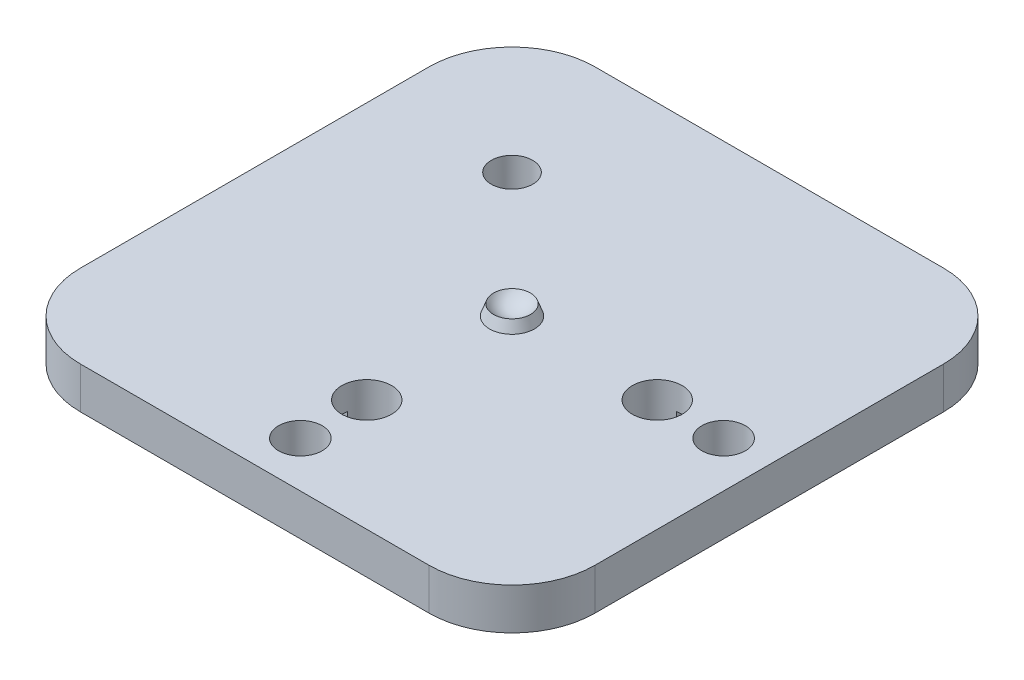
ISO-10303-21;
HEADER;
FILE_DESCRIPTION(('STEP AP214'),'2;1');
FILE_NAME('part.step','',(''),(''),'','','');
FILE_SCHEMA(('AUTOMOTIVE_DESIGN { 1 0 10303 214 1 1 1 1 }'));
ENDSEC;
DATA;
#1=APPLICATION_CONTEXT('core data for automotive mechanical design processes');
#2=APPLICATION_PROTOCOL_DEFINITION('international standard','automotive_design',2000,#1);
#3=PRODUCT_CONTEXT('',#1,'mechanical');
#4=PRODUCT('Part','Part','',(#3));
#5=PRODUCT_RELATED_PRODUCT_CATEGORY('part','',(#4));
#6=PRODUCT_DEFINITION_FORMATION('','',#4);
#7=PRODUCT_DEFINITION_CONTEXT('part definition',#1,'design');
#8=PRODUCT_DEFINITION('design','',#6,#7);
#9=PRODUCT_DEFINITION_SHAPE('','',#8);
#10=(LENGTH_UNIT() NAMED_UNIT(*) SI_UNIT(.MILLI.,.METRE.));
#11=(NAMED_UNIT(*) PLANE_ANGLE_UNIT() SI_UNIT($,.RADIAN.));
#12=(NAMED_UNIT(*) SI_UNIT($,.STERADIAN.) SOLID_ANGLE_UNIT());
#13=UNCERTAINTY_MEASURE_WITH_UNIT(LENGTH_MEASURE(1.E-05),#10,'distance_accuracy_value','');
#14=(GEOMETRIC_REPRESENTATION_CONTEXT(3) GLOBAL_UNCERTAINTY_ASSIGNED_CONTEXT((#13)) GLOBAL_UNIT_ASSIGNED_CONTEXT((#10,
#11,#12)) REPRESENTATION_CONTEXT('',''));
#15=CARTESIAN_POINT('',(0.,0.,0.));
#16=DIRECTION('',(0.,0.,1.));
#17=DIRECTION('',(1.,0.,0.));
#18=AXIS2_PLACEMENT_3D('',#15,#16,#17);
#19=CARTESIAN_POINT('',(0.,0.,0.));
#20=DIRECTION('',(0.,-1.,0.));
#21=DIRECTION('',(0.,0.,-1.));
#22=AXIS2_PLACEMENT_3D('',#19,#20,#21);
#23=CONICAL_SURFACE('',#22,2.7,0.349065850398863);
#24=CARTESIAN_POINT('',(0.,1.28250536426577,0.));
#25=DIRECTION('',(0.,1.,0.));
#26=DIRECTION('',(0.,0.,1.));
#27=AXIS2_PLACEMENT_3D('',#24,#25,#26);
#28=CIRCLE('',#27,2.23320622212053);
#29=CARTESIAN_POINT('',(0.,1.28250536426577,2.23320622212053));
#30=VERTEX_POINT('',#29);
#31=EDGE_CURVE('E421',#30,#30,#28,.T.);
#32=ORIENTED_EDGE('',*,*,#31,.F.);
#33=EDGE_LOOP('',(#32));
#34=FACE_BOUND('',#33,.T.);
#35=CARTESIAN_POINT('',(0.,0.,0.));
#36=DIRECTION('',(0.,1.,0.));
#37=DIRECTION('',(0.,0.,1.));
#38=AXIS2_PLACEMENT_3D('',#35,#36,#37);
#39=CIRCLE('',#38,2.7);
#40=CARTESIAN_POINT('',(0.,0.,2.7));
#41=VERTEX_POINT('',#40);
#42=EDGE_CURVE('E411',#41,#41,#39,.T.);
#43=ORIENTED_EDGE('',*,*,#42,.T.);
#44=EDGE_LOOP('',(#43));
#45=FACE_BOUND('',#44,.T.);
#46=ADVANCED_FACE('F41',(#34,#45),#23,.T.);
#47=CARTESIAN_POINT('',(0.,2.8,0.));
#48=DIRECTION('',(0.,1.,0.));
#49=DIRECTION('',(1.,0.,0.));
#50=AXIS2_PLACEMENT_3D('',#47,#48,#49);
#51=SPHERICAL_SURFACE('',#50,2.7);
#52=ORIENTED_EDGE('',*,*,#31,.T.);
#53=EDGE_LOOP('',(#52));
#54=FACE_BOUND('',#53,.T.);
#55=ADVANCED_FACE('F534',(#54),#51,.F.);
#56=CARTESIAN_POINT('',(0.,-5.,0.));
#57=DIRECTION('',(0.,1.,0.));
#58=DIRECTION('',(0.,0.,1.));
#59=AXIS2_PLACEMENT_3D('',#56,#57,#58);
#60=PLANE('',#59);
#61=DIRECTION('',(0.,0.,-1.));
#62=VECTOR('',#61,1.);
#63=CARTESIAN_POINT('',(-31.,-5.,-31.));
#64=LINE('',#63,#62);
#65=CARTESIAN_POINT('',(-31.,-5.,21.));
#66=VERTEX_POINT('',#65);
#67=CARTESIAN_POINT('',(-31.,-5.,-21.));
#68=VERTEX_POINT('',#67);
#69=EDGE_CURVE('E405',#66,#68,#64,.T.);
#70=ORIENTED_EDGE('',*,*,#69,.T.);
#71=CARTESIAN_POINT('',(-21.,-5.,-21.));
#72=DIRECTION('',(0.,1.,0.));
#73=DIRECTION('',(0.,0.,1.));
#74=AXIS2_PLACEMENT_3D('',#71,#72,#73);
#75=CIRCLE('',#74,10.);
#76=CARTESIAN_POINT('',(-21.,-5.,-31.));
#77=VERTEX_POINT('',#76);
#78=EDGE_CURVE('E486',#68,#77,#75,.F.);
#79=ORIENTED_EDGE('',*,*,#78,.T.);
#80=DIRECTION('',(1.,0.,0.));
#81=VECTOR('',#80,1.);
#82=CARTESIAN_POINT('',(-31.,-5.,-31.));
#83=LINE('',#82,#81);
#84=CARTESIAN_POINT('',(21.,-5.,-31.));
#85=VERTEX_POINT('',#84);
#86=EDGE_CURVE('E408',#77,#85,#83,.T.);
#87=ORIENTED_EDGE('',*,*,#86,.T.);
#88=CARTESIAN_POINT('',(21.,-5.,-21.));
#89=DIRECTION('',(0.,1.,0.));
#90=DIRECTION('',(0.,0.,1.));
#91=AXIS2_PLACEMENT_3D('',#88,#89,#90);
#92=CIRCLE('',#91,10.);
#93=CARTESIAN_POINT('',(31.,-5.,-21.));
#94=VERTEX_POINT('',#93);
#95=EDGE_CURVE('E484',#85,#94,#92,.F.);
#96=ORIENTED_EDGE('',*,*,#95,.T.);
#97=DIRECTION('',(0.,0.,1.));
#98=VECTOR('',#97,1.);
#99=CARTESIAN_POINT('',(31.,-5.,-31.));
#100=LINE('',#99,#98);
#101=CARTESIAN_POINT('',(31.,-5.,21.));
#102=VERTEX_POINT('',#101);
#103=EDGE_CURVE('E400',#94,#102,#100,.T.);
#104=ORIENTED_EDGE('',*,*,#103,.T.);
#105=CARTESIAN_POINT('',(21.,-5.,21.));
#106=DIRECTION('',(0.,1.,0.));
#107=DIRECTION('',(0.,0.,1.));
#108=AXIS2_PLACEMENT_3D('',#105,#106,#107);
#109=CIRCLE('',#108,10.);
#110=CARTESIAN_POINT('',(21.,-5.,31.));
#111=VERTEX_POINT('',#110);
#112=EDGE_CURVE('E61',#102,#111,#109,.F.);
#113=ORIENTED_EDGE('',*,*,#112,.T.);
#114=DIRECTION('',(-1.,0.,0.));
#115=VECTOR('',#114,1.);
#116=CARTESIAN_POINT('',(-31.,-5.,31.));
#117=LINE('',#116,#115);
#118=CARTESIAN_POINT('',(-21.,-5.,31.));
#119=VERTEX_POINT('',#118);
#120=EDGE_CURVE('E402',#111,#119,#117,.T.);
#121=ORIENTED_EDGE('',*,*,#120,.T.);
#122=CARTESIAN_POINT('',(-21.,-5.,21.));
#123=DIRECTION('',(0.,1.,0.));
#124=DIRECTION('',(0.,0.,1.));
#125=AXIS2_PLACEMENT_3D('',#122,#123,#124);
#126=CIRCLE('',#125,10.);
#127=EDGE_CURVE('E482',#119,#66,#126,.F.);
#128=ORIENTED_EDGE('',*,*,#127,.T.);
#129=EDGE_LOOP('',(#70,#79,#87,#96,#104,#113,#121,#128));
#130=FACE_BOUND('',#129,.T.);
#131=CARTESIAN_POINT('',(17.5,-5.,0.));
#132=DIRECTION('',(0.,-1.,0.));
#133=DIRECTION('',(0.,0.,-1.));
#134=AXIS2_PLACEMENT_3D('',#131,#132,#133);
#135=CIRCLE('',#134,2.99999999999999);
#136=CARTESIAN_POINT('',(16.9,-5.,2.93938769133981));
#137=VERTEX_POINT('',#136);
#138=CARTESIAN_POINT('',(16.9,-5.,-2.93938769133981));
#139=VERTEX_POINT('',#138);
#140=EDGE_CURVE('E396',#137,#139,#135,.T.);
#141=ORIENTED_EDGE('',*,*,#140,.F.);
#142=DIRECTION('',(0.,0.,-1.));
#143=VECTOR('',#142,1.);
#144=CARTESIAN_POINT('',(16.9,-5.,-5.2));
#145=LINE('',#144,#143);
#146=CARTESIAN_POINT('',(16.9,-5.,5.2));
#147=VERTEX_POINT('',#146);
#148=EDGE_CURVE('E287',#147,#137,#145,.T.);
#149=ORIENTED_EDGE('',*,*,#148,.F.);
#150=DIRECTION('',(-1.,0.,0.));
#151=VECTOR('',#150,1.);
#152=CARTESIAN_POINT('',(16.9,-5.,5.2));
#153=LINE('',#152,#151);
#154=CARTESIAN_POINT('',(18.1,-5.,5.2));
#155=VERTEX_POINT('',#154);
#156=EDGE_CURVE('E312',#155,#147,#153,.T.);
#157=ORIENTED_EDGE('',*,*,#156,.F.);
#158=DIRECTION('',(0.,0.,1.));
#159=VECTOR('',#158,1.);
#160=CARTESIAN_POINT('',(18.1,-5.,5.2));
#161=LINE('',#160,#159);
#162=CARTESIAN_POINT('',(18.1,-5.,2.93938769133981));
#163=VERTEX_POINT('',#162);
#164=EDGE_CURVE('E315',#163,#155,#161,.T.);
#165=ORIENTED_EDGE('',*,*,#164,.F.);
#166=CARTESIAN_POINT('',(18.1,-5.,-2.93938769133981));
#167=VERTEX_POINT('',#166);
#168=EDGE_CURVE('E392',#167,#163,#135,.T.);
#169=ORIENTED_EDGE('',*,*,#168,.F.);
#170=CARTESIAN_POINT('',(18.1,-5.,-5.2));
#171=VERTEX_POINT('',#170);
#172=EDGE_CURVE('E317',#171,#167,#161,.T.);
#173=ORIENTED_EDGE('',*,*,#172,.F.);
#174=DIRECTION('',(1.,0.,0.));
#175=VECTOR('',#174,1.);
#176=CARTESIAN_POINT('',(18.1,-5.,-5.2));
#177=LINE('',#176,#175);
#178=CARTESIAN_POINT('',(16.9,-5.,-5.2));
#179=VERTEX_POINT('',#178);
#180=EDGE_CURVE('E319',#179,#171,#177,.T.);
#181=ORIENTED_EDGE('',*,*,#180,.F.);
#182=EDGE_CURVE('E322',#139,#179,#145,.T.);
#183=ORIENTED_EDGE('',*,*,#182,.F.);
#184=EDGE_LOOP('',(#141,#149,#157,#165,#169,#173,#181,#183));
#185=FACE_BOUND('',#184,.T.);
#186=CARTESIAN_POINT('',(0.,-5.,17.5));
#187=DIRECTION('',(0.,-1.,0.));
#188=DIRECTION('',(0.,0.,-1.));
#189=AXIS2_PLACEMENT_3D('',#186,#187,#188);
#190=CIRCLE('',#189,3.);
#191=CARTESIAN_POINT('',(2.93938769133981,-5.,18.1));
#192=VERTEX_POINT('',#191);
#193=CARTESIAN_POINT('',(-2.93938769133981,-5.,18.1));
#194=VERTEX_POINT('',#193);
#195=EDGE_CURVE('E388',#192,#194,#190,.T.);
#196=ORIENTED_EDGE('',*,*,#195,.F.);
#197=DIRECTION('',(-1.,0.,0.));
#198=VECTOR('',#197,1.);
#199=CARTESIAN_POINT('',(-5.2,-5.,18.1));
#200=LINE('',#199,#198);
#201=CARTESIAN_POINT('',(5.2,-5.,18.1));
#202=VERTEX_POINT('',#201);
#203=EDGE_CURVE('E277',#202,#192,#200,.T.);
#204=ORIENTED_EDGE('',*,*,#203,.F.);
#205=DIRECTION('',(0.,0.,1.));
#206=VECTOR('',#205,1.);
#207=CARTESIAN_POINT('',(5.2,-5.,18.1));
#208=LINE('',#207,#206);
#209=CARTESIAN_POINT('',(5.2,-5.,16.9));
#210=VERTEX_POINT('',#209);
#211=EDGE_CURVE('E290',#210,#202,#208,.T.);
#212=ORIENTED_EDGE('',*,*,#211,.F.);
#213=DIRECTION('',(1.,0.,0.));
#214=VECTOR('',#213,1.);
#215=CARTESIAN_POINT('',(5.2,-5.,16.9));
#216=LINE('',#215,#214);
#217=CARTESIAN_POINT('',(2.93938769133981,-5.,16.9));
#218=VERTEX_POINT('',#217);
#219=EDGE_CURVE('E286',#218,#210,#216,.T.);
#220=ORIENTED_EDGE('',*,*,#219,.F.);
#221=CARTESIAN_POINT('',(-2.93938769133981,-5.,16.9));
#222=VERTEX_POINT('',#221);
#223=EDGE_CURVE('E385',#222,#218,#190,.T.);
#224=ORIENTED_EDGE('',*,*,#223,.F.);
#225=CARTESIAN_POINT('',(-5.2,-5.,16.9));
#226=VERTEX_POINT('',#225);
#227=EDGE_CURVE('E288',#226,#222,#216,.T.);
#228=ORIENTED_EDGE('',*,*,#227,.F.);
#229=DIRECTION('',(0.,0.,-1.));
#230=VECTOR('',#229,1.);
#231=CARTESIAN_POINT('',(-5.2,-5.,16.9));
#232=LINE('',#231,#230);
#233=CARTESIAN_POINT('',(-5.2,-5.,18.1));
#234=VERTEX_POINT('',#233);
#235=EDGE_CURVE('E257',#234,#226,#232,.T.);
#236=ORIENTED_EDGE('',*,*,#235,.F.);
#237=EDGE_CURVE('E279',#194,#234,#200,.T.);
#238=ORIENTED_EDGE('',*,*,#237,.F.);
#239=EDGE_LOOP('',(#196,#204,#212,#220,#224,#228,#236,#238));
#240=FACE_BOUND('',#239,.T.);
#241=CARTESIAN_POINT('',(-15.,-5.,-15.));
#242=DIRECTION('',(0.,-1.,0.));
#243=DIRECTION('',(0.,0.,-1.));
#244=AXIS2_PLACEMENT_3D('',#241,#242,#243);
#245=CIRCLE('',#244,2.5);
#246=CARTESIAN_POINT('',(-12.859635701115,-5.,-16.2918361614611));
#247=VERTEX_POINT('',#246);
#248=CARTESIAN_POINT('',(-16.2918361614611,-5.,-12.859635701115));
#249=VERTEX_POINT('',#248);
#250=EDGE_CURVE('E382',#247,#249,#245,.T.);
#251=ORIENTED_EDGE('',*,*,#250,.F.);
#252=DIRECTION('',(-0.707106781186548,0.,0.707106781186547));
#253=VECTOR('',#252,1.);
#254=CARTESIAN_POINT('',(-18.2526911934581,-5.,-10.898780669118));
#255=LINE('',#254,#253);
#256=CARTESIAN_POINT('',(-10.898780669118,-5.,-18.2526911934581));
#257=VERTEX_POINT('',#256);
#258=EDGE_CURVE('E345',#257,#247,#255,.T.);
#259=ORIENTED_EDGE('',*,*,#258,.F.);
#260=DIRECTION('',(0.707106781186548,0.,0.707106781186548));
#261=VECTOR('',#260,1.);
#262=CARTESIAN_POINT('',(-10.898780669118,-5.,-18.2526911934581));
#263=LINE('',#262,#261);
#264=CARTESIAN_POINT('',(-11.7473088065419,-5.,-19.101219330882));
#265=VERTEX_POINT('',#264);
#266=EDGE_CURVE('E347',#265,#257,#263,.T.);
#267=ORIENTED_EDGE('',*,*,#266,.F.);
#268=DIRECTION('',(0.707106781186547,0.,-0.707106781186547));
#269=VECTOR('',#268,1.);
#270=CARTESIAN_POINT('',(-11.7473088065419,-5.,-19.101219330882));
#271=LINE('',#270,#269);
#272=CARTESIAN_POINT('',(-13.7081638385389,-5.,-17.140364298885));
#273=VERTEX_POINT('',#272);
#274=EDGE_CURVE('E351',#273,#265,#271,.T.);
#275=ORIENTED_EDGE('',*,*,#274,.F.);
#276=CARTESIAN_POINT('',(-17.140364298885,-5.,-13.7081638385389));
#277=VERTEX_POINT('',#276);
#278=EDGE_CURVE('E379',#277,#273,#245,.T.);
#279=ORIENTED_EDGE('',*,*,#278,.F.);
#280=CARTESIAN_POINT('',(-19.101219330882,-5.,-11.7473088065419));
#281=VERTEX_POINT('',#280);
#282=EDGE_CURVE('E352',#281,#277,#271,.T.);
#283=ORIENTED_EDGE('',*,*,#282,.F.);
#284=DIRECTION('',(-0.707106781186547,0.,-0.707106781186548));
#285=VECTOR('',#284,1.);
#286=CARTESIAN_POINT('',(-19.101219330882,-5.,-11.7473088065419));
#287=LINE('',#286,#285);
#288=CARTESIAN_POINT('',(-18.2526911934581,-5.,-10.898780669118));
#289=VERTEX_POINT('',#288);
#290=EDGE_CURVE('E311',#289,#281,#287,.T.);
#291=ORIENTED_EDGE('',*,*,#290,.F.);
#292=EDGE_CURVE('E348',#249,#289,#255,.T.);
#293=ORIENTED_EDGE('',*,*,#292,.F.);
#294=EDGE_LOOP('',(#251,#259,#267,#275,#279,#283,#291,#293));
#295=FACE_BOUND('',#294,.T.);
#296=CARTESIAN_POINT('',(0.,-5.,25.5));
#297=DIRECTION('',(0.,-1.,0.));
#298=DIRECTION('',(0.,0.,-1.));
#299=AXIS2_PLACEMENT_3D('',#296,#297,#298);
#300=CIRCLE('',#299,2.625);
#301=CARTESIAN_POINT('',(0.,-5.,22.875));
#302=VERTEX_POINT('',#301);
#303=EDGE_CURVE('E373',#302,#302,#300,.T.);
#304=ORIENTED_EDGE('',*,*,#303,.F.);
#305=EDGE_LOOP('',(#304));
#306=FACE_BOUND('',#305,.T.);
#307=CARTESIAN_POINT('',(25.5,-5.,0.));
#308=DIRECTION('',(0.,-1.,0.));
#309=DIRECTION('',(0.,0.,-1.));
#310=AXIS2_PLACEMENT_3D('',#307,#308,#309);
#311=CIRCLE('',#310,2.625);
#312=CARTESIAN_POINT('',(25.5,-5.,-2.625));
#313=VERTEX_POINT('',#312);
#314=EDGE_CURVE('E367',#313,#313,#311,.T.);
#315=ORIENTED_EDGE('',*,*,#314,.F.);
#316=EDGE_LOOP('',(#315));
#317=FACE_BOUND('',#316,.T.);
#318=ADVANCED_FACE('F512',(#130,#185,#240,#295,#306,#317),#60,.F.);
#319=CARTESIAN_POINT('',(0.,0.,0.));
#320=DIRECTION('',(0.,1.,0.));
#321=DIRECTION('',(0.,0.,1.));
#322=AXIS2_PLACEMENT_3D('',#319,#320,#321);
#323=PLANE('',#322);
#324=ORIENTED_EDGE('',*,*,#42,.F.);
#325=EDGE_LOOP('',(#324));
#326=FACE_BOUND('',#325,.T.);
#327=CARTESIAN_POINT('',(0.,0.,25.5));
#328=DIRECTION('',(0.,-1.,0.));
#329=DIRECTION('',(0.,0.,-1.));
#330=AXIS2_PLACEMENT_3D('',#327,#328,#329);
#331=CIRCLE('',#330,2.625);
#332=CARTESIAN_POINT('',(0.,0.,22.875));
#333=VERTEX_POINT('',#332);
#334=EDGE_CURVE('E370',#333,#333,#331,.T.);
#335=ORIENTED_EDGE('',*,*,#334,.T.);
#336=EDGE_LOOP('',(#335));
#337=FACE_BOUND('',#336,.T.);
#338=CARTESIAN_POINT('',(0.,0.,17.5));
#339=DIRECTION('',(0.,-1.,0.));
#340=DIRECTION('',(0.,0.,-1.));
#341=AXIS2_PLACEMENT_3D('',#338,#339,#340);
#342=CIRCLE('',#341,3.);
#343=CARTESIAN_POINT('',(0.,0.,14.5));
#344=VERTEX_POINT('',#343);
#345=EDGE_CURVE('E389',#344,#344,#342,.T.);
#346=ORIENTED_EDGE('',*,*,#345,.T.);
#347=EDGE_LOOP('',(#346));
#348=FACE_BOUND('',#347,.T.);
#349=DIRECTION('',(1.,0.,0.));
#350=VECTOR('',#349,1.);
#351=CARTESIAN_POINT('',(-31.,0.,-31.));
#352=LINE('',#351,#350);
#353=CARTESIAN_POINT('',(-21.,0.,-31.));
#354=VERTEX_POINT('',#353);
#355=CARTESIAN_POINT('',(21.,0.,-31.));
#356=VERTEX_POINT('',#355);
#357=EDGE_CURVE('E403',#354,#356,#352,.T.);
#358=ORIENTED_EDGE('',*,*,#357,.F.);
#359=CARTESIAN_POINT('',(-21.,0.,-21.));
#360=DIRECTION('',(0.,1.,0.));
#361=DIRECTION('',(0.,0.,1.));
#362=AXIS2_PLACEMENT_3D('',#359,#360,#361);
#363=CIRCLE('',#362,10.);
#364=CARTESIAN_POINT('',(-31.,0.,-21.));
#365=VERTEX_POINT('',#364);
#366=EDGE_CURVE('E474',#354,#365,#363,.T.);
#367=ORIENTED_EDGE('',*,*,#366,.T.);
#368=DIRECTION('',(0.,0.,-1.));
#369=VECTOR('',#368,1.);
#370=CARTESIAN_POINT('',(-31.,0.,-31.));
#371=LINE('',#370,#369);
#372=CARTESIAN_POINT('',(-31.,0.,21.));
#373=VERTEX_POINT('',#372);
#374=EDGE_CURVE('E416',#373,#365,#371,.T.);
#375=ORIENTED_EDGE('',*,*,#374,.F.);
#376=CARTESIAN_POINT('',(-21.,0.,21.));
#377=DIRECTION('',(0.,1.,0.));
#378=DIRECTION('',(0.,0.,1.));
#379=AXIS2_PLACEMENT_3D('',#376,#377,#378);
#380=CIRCLE('',#379,10.);
#381=CARTESIAN_POINT('',(-21.,0.,31.));
#382=VERTEX_POINT('',#381);
#383=EDGE_CURVE('E470',#373,#382,#380,.T.);
#384=ORIENTED_EDGE('',*,*,#383,.T.);
#385=DIRECTION('',(-1.,0.,0.));
#386=VECTOR('',#385,1.);
#387=CARTESIAN_POINT('',(-31.,0.,31.));
#388=LINE('',#387,#386);
#389=CARTESIAN_POINT('',(21.,0.,31.));
#390=VERTEX_POINT('',#389);
#391=EDGE_CURVE('E414',#390,#382,#388,.T.);
#392=ORIENTED_EDGE('',*,*,#391,.F.);
#393=CARTESIAN_POINT('',(21.,0.,21.));
#394=DIRECTION('',(0.,1.,0.));
#395=DIRECTION('',(0.,0.,1.));
#396=AXIS2_PLACEMENT_3D('',#393,#394,#395);
#397=CIRCLE('',#396,10.);
#398=CARTESIAN_POINT('',(31.,0.,21.));
#399=VERTEX_POINT('',#398);
#400=EDGE_CURVE('E468',#390,#399,#397,.T.);
#401=ORIENTED_EDGE('',*,*,#400,.T.);
#402=DIRECTION('',(0.,0.,1.));
#403=VECTOR('',#402,1.);
#404=CARTESIAN_POINT('',(31.,0.,-31.));
#405=LINE('',#404,#403);
#406=CARTESIAN_POINT('',(31.,0.,-21.));
#407=VERTEX_POINT('',#406);
#408=EDGE_CURVE('E395',#407,#399,#405,.T.);
#409=ORIENTED_EDGE('',*,*,#408,.F.);
#410=CARTESIAN_POINT('',(21.,0.,-21.));
#411=DIRECTION('',(0.,1.,0.));
#412=DIRECTION('',(0.,0.,1.));
#413=AXIS2_PLACEMENT_3D('',#410,#411,#412);
#414=CIRCLE('',#413,10.);
#415=EDGE_CURVE('E472',#407,#356,#414,.T.);
#416=ORIENTED_EDGE('',*,*,#415,.T.);
#417=EDGE_LOOP('',(#358,#367,#375,#384,#392,#401,#409,#416));
#418=FACE_BOUND('',#417,.T.);
#419=CARTESIAN_POINT('',(17.5,0.,0.));
#420=DIRECTION('',(0.,-1.,0.));
#421=DIRECTION('',(0.,0.,-1.));
#422=AXIS2_PLACEMENT_3D('',#419,#420,#421);
#423=CIRCLE('',#422,2.99999999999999);
#424=CARTESIAN_POINT('',(17.5,0.,-2.99999999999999));
#425=VERTEX_POINT('',#424);
#426=EDGE_CURVE('E397',#425,#425,#423,.T.);
#427=ORIENTED_EDGE('',*,*,#426,.T.);
#428=EDGE_LOOP('',(#427));
#429=FACE_BOUND('',#428,.T.);
#430=CARTESIAN_POINT('',(-15.,0.,-15.));
#431=DIRECTION('',(0.,-1.,0.));
#432=DIRECTION('',(0.,0.,-1.));
#433=AXIS2_PLACEMENT_3D('',#430,#431,#432);
#434=CIRCLE('',#433,2.5);
#435=CARTESIAN_POINT('',(-15.,0.,-17.5));
#436=VERTEX_POINT('',#435);
#437=EDGE_CURVE('E376',#436,#436,#434,.T.);
#438=ORIENTED_EDGE('',*,*,#437,.T.);
#439=EDGE_LOOP('',(#438));
#440=FACE_BOUND('',#439,.T.);
#441=CARTESIAN_POINT('',(25.5,0.,0.));
#442=DIRECTION('',(0.,-1.,0.));
#443=DIRECTION('',(0.,0.,-1.));
#444=AXIS2_PLACEMENT_3D('',#441,#442,#443);
#445=CIRCLE('',#444,2.625);
#446=CARTESIAN_POINT('',(25.5,0.,-2.625));
#447=VERTEX_POINT('',#446);
#448=EDGE_CURVE('E295',#447,#447,#445,.T.);
#449=ORIENTED_EDGE('',*,*,#448,.T.);
#450=EDGE_LOOP('',(#449));
#451=FACE_BOUND('',#450,.T.);
#452=ADVANCED_FACE('F499',(#326,#337,#348,#418,#429,#440,#451),#323,.T.);
#453=CARTESIAN_POINT('',(31.,-5.,-31.));
#454=DIRECTION('',(-1.,0.,0.));
#455=DIRECTION('',(0.,0.,1.));
#456=AXIS2_PLACEMENT_3D('',#453,#454,#455);
#457=PLANE('',#456);
#458=ORIENTED_EDGE('',*,*,#103,.F.);
#459=DIRECTION('',(0.,1.,0.));
#460=VECTOR('',#459,1.);
#461=CARTESIAN_POINT('',(31.,-5.,-21.));
#462=LINE('',#461,#460);
#463=EDGE_CURVE('E490',#94,#407,#462,.T.);
#464=ORIENTED_EDGE('',*,*,#463,.T.);
#465=ORIENTED_EDGE('',*,*,#408,.T.);
#466=DIRECTION('',(0.,1.,0.));
#467=VECTOR('',#466,1.);
#468=CARTESIAN_POINT('',(31.,-5.,21.));
#469=LINE('',#468,#467);
#470=EDGE_CURVE('E488',#399,#102,#469,.F.);
#471=ORIENTED_EDGE('',*,*,#470,.T.);
#472=EDGE_LOOP('',(#458,#464,#465,#471));
#473=FACE_BOUND('',#472,.T.);
#474=ADVANCED_FACE('F527',(#473),#457,.F.);
#475=CARTESIAN_POINT('',(-31.,-5.,31.));
#476=DIRECTION('',(0.,0.,-1.));
#477=DIRECTION('',(-1.,0.,0.));
#478=AXIS2_PLACEMENT_3D('',#475,#476,#477);
#479=PLANE('',#478);
#480=ORIENTED_EDGE('',*,*,#391,.T.);
#481=DIRECTION('',(0.,1.,0.));
#482=VECTOR('',#481,1.);
#483=CARTESIAN_POINT('',(-21.,-5.,31.));
#484=LINE('',#483,#482);
#485=EDGE_CURVE('E11',#382,#119,#484,.F.);
#486=ORIENTED_EDGE('',*,*,#485,.T.);
#487=ORIENTED_EDGE('',*,*,#120,.F.);
#488=DIRECTION('',(0.,1.,0.));
#489=VECTOR('',#488,1.);
#490=CARTESIAN_POINT('',(21.,-5.,31.));
#491=LINE('',#490,#489);
#492=EDGE_CURVE('E49',#111,#390,#491,.T.);
#493=ORIENTED_EDGE('',*,*,#492,.T.);
#494=EDGE_LOOP('',(#480,#486,#487,#493));
#495=FACE_BOUND('',#494,.T.);
#496=ADVANCED_FACE('F495',(#495),#479,.F.);
#497=CARTESIAN_POINT('',(-31.,-5.,-31.));
#498=DIRECTION('',(1.,0.,0.));
#499=DIRECTION('',(0.,0.,-1.));
#500=AXIS2_PLACEMENT_3D('',#497,#498,#499);
#501=PLANE('',#500);
#502=ORIENTED_EDGE('',*,*,#374,.T.);
#503=DIRECTION('',(0.,1.,0.));
#504=VECTOR('',#503,1.);
#505=CARTESIAN_POINT('',(-31.,-5.,-21.));
#506=LINE('',#505,#504);
#507=EDGE_CURVE('E479',#365,#68,#506,.F.);
#508=ORIENTED_EDGE('',*,*,#507,.T.);
#509=ORIENTED_EDGE('',*,*,#69,.F.);
#510=DIRECTION('',(0.,1.,0.));
#511=VECTOR('',#510,1.);
#512=CARTESIAN_POINT('',(-31.,-5.,21.));
#513=LINE('',#512,#511);
#514=EDGE_CURVE('E476',#66,#373,#513,.T.);
#515=ORIENTED_EDGE('',*,*,#514,.T.);
#516=EDGE_LOOP('',(#502,#508,#509,#515));
#517=FACE_BOUND('',#516,.T.);
#518=ADVANCED_FACE('F509',(#517),#501,.F.);
#519=CARTESIAN_POINT('',(-31.,-5.,-31.));
#520=DIRECTION('',(0.,0.,1.));
#521=DIRECTION('',(1.,0.,0.));
#522=AXIS2_PLACEMENT_3D('',#519,#520,#521);
#523=PLANE('',#522);
#524=ORIENTED_EDGE('',*,*,#86,.F.);
#525=DIRECTION('',(0.,1.,0.));
#526=VECTOR('',#525,1.);
#527=CARTESIAN_POINT('',(-21.,-5.,-31.));
#528=LINE('',#527,#526);
#529=EDGE_CURVE('E465',#77,#354,#528,.T.);
#530=ORIENTED_EDGE('',*,*,#529,.T.);
#531=ORIENTED_EDGE('',*,*,#357,.T.);
#532=DIRECTION('',(0.,1.,0.));
#533=VECTOR('',#532,1.);
#534=CARTESIAN_POINT('',(21.,-5.,-31.));
#535=LINE('',#534,#533);
#536=EDGE_CURVE('E463',#356,#85,#535,.F.);
#537=ORIENTED_EDGE('',*,*,#536,.T.);
#538=EDGE_LOOP('',(#524,#530,#531,#537));
#539=FACE_BOUND('',#538,.T.);
#540=ADVANCED_FACE('F519',(#539),#523,.F.);
#541=CARTESIAN_POINT('',(17.5,-5.,0.));
#542=DIRECTION('',(0.,1.,0.));
#543=DIRECTION('',(0.,0.,1.));
#544=AXIS2_PLACEMENT_3D('',#541,#542,#543);
#545=CYLINDRICAL_SURFACE('',#544,2.99999999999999);
#546=DIRECTION('',(0.,1.,0.));
#547=VECTOR('',#546,1.);
#548=CARTESIAN_POINT('',(16.9,-5.,-2.93938769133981));
#549=LINE('',#548,#547);
#550=CARTESIAN_POINT('',(16.9,-3.,-2.93938769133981));
#551=VERTEX_POINT('',#550);
#552=EDGE_CURVE('E461',#551,#139,#549,.F.);
#553=ORIENTED_EDGE('',*,*,#552,.F.);
#554=CARTESIAN_POINT('',(17.5,-3.,0.));
#555=DIRECTION('',(0.,1.,0.));
#556=DIRECTION('',(0.,0.,1.));
#557=AXIS2_PLACEMENT_3D('',#554,#555,#556);
#558=CIRCLE('',#557,2.99999999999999);
#559=CARTESIAN_POINT('',(18.1,-3.,-2.93938769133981));
#560=VERTEX_POINT('',#559);
#561=EDGE_CURVE('E453',#560,#551,#558,.T.);
#562=ORIENTED_EDGE('',*,*,#561,.F.);
#563=DIRECTION('',(0.,1.,0.));
#564=VECTOR('',#563,1.);
#565=CARTESIAN_POINT('',(18.1,-5.,-2.93938769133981));
#566=LINE('',#565,#564);
#567=EDGE_CURVE('E458',#167,#560,#566,.T.);
#568=ORIENTED_EDGE('',*,*,#567,.F.);
#569=ORIENTED_EDGE('',*,*,#168,.T.);
#570=DIRECTION('',(0.,1.,0.));
#571=VECTOR('',#570,1.);
#572=CARTESIAN_POINT('',(18.1,-5.,2.93938769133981));
#573=LINE('',#572,#571);
#574=CARTESIAN_POINT('',(18.1,-3.,2.93938769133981));
#575=VERTEX_POINT('',#574);
#576=EDGE_CURVE('E452',#575,#163,#573,.F.);
#577=ORIENTED_EDGE('',*,*,#576,.F.);
#578=CARTESIAN_POINT('',(16.9,-3.,2.93938769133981));
#579=VERTEX_POINT('',#578);
#580=EDGE_CURVE('E450',#579,#575,#558,.T.);
#581=ORIENTED_EDGE('',*,*,#580,.F.);
#582=DIRECTION('',(0.,1.,0.));
#583=VECTOR('',#582,1.);
#584=CARTESIAN_POINT('',(16.9,-5.,2.93938769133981));
#585=LINE('',#584,#583);
#586=EDGE_CURVE('E455',#137,#579,#585,.T.);
#587=ORIENTED_EDGE('',*,*,#586,.F.);
#588=ORIENTED_EDGE('',*,*,#140,.T.);
#589=EDGE_LOOP('',(#553,#562,#568,#569,#577,#581,#587,#588));
#590=FACE_BOUND('',#589,.T.);
#591=ORIENTED_EDGE('',*,*,#426,.F.);
#592=EDGE_LOOP('',(#591));
#593=FACE_BOUND('',#592,.T.);
#594=ADVANCED_FACE('F806',(#590,#593),#545,.F.);
#595=CARTESIAN_POINT('',(0.,-5.,17.5));
#596=DIRECTION('',(0.,1.,0.));
#597=DIRECTION('',(0.,0.,1.));
#598=AXIS2_PLACEMENT_3D('',#595,#596,#597);
#599=CYLINDRICAL_SURFACE('',#598,3.);
#600=DIRECTION('',(0.,1.,0.));
#601=VECTOR('',#600,1.);
#602=CARTESIAN_POINT('',(2.93938769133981,-5.,18.1));
#603=LINE('',#602,#601);
#604=CARTESIAN_POINT('',(2.93938769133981,-3.,18.1));
#605=VERTEX_POINT('',#604);
#606=EDGE_CURVE('E447',#192,#605,#603,.T.);
#607=ORIENTED_EDGE('',*,*,#606,.F.);
#608=ORIENTED_EDGE('',*,*,#195,.T.);
#609=DIRECTION('',(0.,1.,0.));
#610=VECTOR('',#609,1.);
#611=CARTESIAN_POINT('',(-2.93938769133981,-5.,18.1));
#612=LINE('',#611,#610);
#613=CARTESIAN_POINT('',(-2.93938769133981,-3.,18.1));
#614=VERTEX_POINT('',#613);
#615=EDGE_CURVE('E443',#614,#194,#612,.F.);
#616=ORIENTED_EDGE('',*,*,#615,.F.);
#617=CARTESIAN_POINT('',(0.,-3.,17.5));
#618=DIRECTION('',(0.,1.,0.));
#619=DIRECTION('',(0.,0.,1.));
#620=AXIS2_PLACEMENT_3D('',#617,#618,#619);
#621=CIRCLE('',#620,3.);
#622=CARTESIAN_POINT('',(-2.93938769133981,-3.,16.9));
#623=VERTEX_POINT('',#622);
#624=EDGE_CURVE('E439',#623,#614,#621,.T.);
#625=ORIENTED_EDGE('',*,*,#624,.F.);
#626=DIRECTION('',(0.,1.,0.));
#627=VECTOR('',#626,1.);
#628=CARTESIAN_POINT('',(-2.93938769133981,-5.,16.9));
#629=LINE('',#628,#627);
#630=EDGE_CURVE('E267',#222,#623,#629,.T.);
#631=ORIENTED_EDGE('',*,*,#630,.F.);
#632=ORIENTED_EDGE('',*,*,#223,.T.);
#633=DIRECTION('',(0.,1.,0.));
#634=VECTOR('',#633,1.);
#635=CARTESIAN_POINT('',(2.93938769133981,-5.,16.9));
#636=LINE('',#635,#634);
#637=CARTESIAN_POINT('',(2.93938769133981,-3.,16.9));
#638=VERTEX_POINT('',#637);
#639=EDGE_CURVE('E445',#638,#218,#636,.F.);
#640=ORIENTED_EDGE('',*,*,#639,.F.);
#641=EDGE_CURVE('E441',#605,#638,#621,.T.);
#642=ORIENTED_EDGE('',*,*,#641,.F.);
#643=EDGE_LOOP('',(#607,#608,#616,#625,#631,#632,#640,#642));
#644=FACE_BOUND('',#643,.T.);
#645=ORIENTED_EDGE('',*,*,#345,.F.);
#646=EDGE_LOOP('',(#645));
#647=FACE_BOUND('',#646,.T.);
#648=ADVANCED_FACE('F797',(#644,#647),#599,.F.);
#649=CARTESIAN_POINT('',(-15.,-5.,-15.));
#650=DIRECTION('',(0.,1.,0.));
#651=DIRECTION('',(0.,0.,1.));
#652=AXIS2_PLACEMENT_3D('',#649,#650,#651);
#653=CYLINDRICAL_SURFACE('',#652,2.5);
#654=DIRECTION('',(0.,1.,0.));
#655=VECTOR('',#654,1.);
#656=CARTESIAN_POINT('',(-12.859635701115,-5.,-16.2918361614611));
#657=LINE('',#656,#655);
#658=CARTESIAN_POINT('',(-12.859635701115,-3.,-16.2918361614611));
#659=VERTEX_POINT('',#658);
#660=EDGE_CURVE('E436',#247,#659,#657,.T.);
#661=ORIENTED_EDGE('',*,*,#660,.F.);
#662=ORIENTED_EDGE('',*,*,#250,.T.);
#663=DIRECTION('',(0.,1.,0.));
#664=VECTOR('',#663,1.);
#665=CARTESIAN_POINT('',(-16.2918361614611,-5.,-12.859635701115));
#666=LINE('',#665,#664);
#667=CARTESIAN_POINT('',(-16.2918361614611,-3.,-12.859635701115));
#668=VERTEX_POINT('',#667);
#669=EDGE_CURVE('E432',#668,#249,#666,.F.);
#670=ORIENTED_EDGE('',*,*,#669,.F.);
#671=CARTESIAN_POINT('',(-15.,-3.,-15.));
#672=DIRECTION('',(0.,1.,0.));
#673=DIRECTION('',(0.,0.,1.));
#674=AXIS2_PLACEMENT_3D('',#671,#672,#673);
#675=CIRCLE('',#674,2.5);
#676=CARTESIAN_POINT('',(-17.140364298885,-3.,-13.7081638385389));
#677=VERTEX_POINT('',#676);
#678=EDGE_CURVE('E424',#677,#668,#675,.T.);
#679=ORIENTED_EDGE('',*,*,#678,.F.);
#680=DIRECTION('',(0.,1.,0.));
#681=VECTOR('',#680,1.);
#682=CARTESIAN_POINT('',(-17.140364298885,-5.,-13.7081638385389));
#683=LINE('',#682,#681);
#684=EDGE_CURVE('E428',#277,#677,#683,.T.);
#685=ORIENTED_EDGE('',*,*,#684,.F.);
#686=ORIENTED_EDGE('',*,*,#278,.T.);
#687=DIRECTION('',(0.,1.,0.));
#688=VECTOR('',#687,1.);
#689=CARTESIAN_POINT('',(-13.7081638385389,-5.,-17.140364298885));
#690=LINE('',#689,#688);
#691=CARTESIAN_POINT('',(-13.7081638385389,-3.,-17.140364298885));
#692=VERTEX_POINT('',#691);
#693=EDGE_CURVE('E434',#692,#273,#690,.F.);
#694=ORIENTED_EDGE('',*,*,#693,.F.);
#695=EDGE_CURVE('E429',#659,#692,#675,.T.);
#696=ORIENTED_EDGE('',*,*,#695,.F.);
#697=EDGE_LOOP('',(#661,#662,#670,#679,#685,#686,#694,#696));
#698=FACE_BOUND('',#697,.T.);
#699=ORIENTED_EDGE('',*,*,#437,.F.);
#700=EDGE_LOOP('',(#699));
#701=FACE_BOUND('',#700,.T.);
#702=ADVANCED_FACE('F788',(#698,#701),#653,.F.);
#703=CARTESIAN_POINT('',(0.,-5.,25.5));
#704=DIRECTION('',(0.,1.,0.));
#705=DIRECTION('',(0.,0.,1.));
#706=AXIS2_PLACEMENT_3D('',#703,#704,#705);
#707=CYLINDRICAL_SURFACE('',#706,2.625);
#708=ORIENTED_EDGE('',*,*,#303,.T.);
#709=EDGE_LOOP('',(#708));
#710=FACE_BOUND('',#709,.T.);
#711=ORIENTED_EDGE('',*,*,#334,.F.);
#712=EDGE_LOOP('',(#711));
#713=FACE_BOUND('',#712,.T.);
#714=ADVANCED_FACE('F779',(#710,#713),#707,.F.);
#715=CARTESIAN_POINT('',(25.5,-5.,0.));
#716=DIRECTION('',(0.,1.,0.));
#717=DIRECTION('',(0.,0.,1.));
#718=AXIS2_PLACEMENT_3D('',#715,#716,#717);
#719=CYLINDRICAL_SURFACE('',#718,2.625);
#720=ORIENTED_EDGE('',*,*,#314,.T.);
#721=EDGE_LOOP('',(#720));
#722=FACE_BOUND('',#721,.T.);
#723=ORIENTED_EDGE('',*,*,#448,.F.);
#724=EDGE_LOOP('',(#723));
#725=FACE_BOUND('',#724,.T.);
#726=ADVANCED_FACE('F771',(#722,#725),#719,.F.);
#727=CARTESIAN_POINT('',(0.,-3.,0.));
#728=DIRECTION('',(0.,1.,0.));
#729=DIRECTION('',(0.,0.,1.));
#730=AXIS2_PLACEMENT_3D('',#727,#728,#729);
#731=PLANE('',#730);
#732=ORIENTED_EDGE('',*,*,#678,.T.);
#733=DIRECTION('',(-0.707106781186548,0.,0.707106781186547));
#734=VECTOR('',#733,1.);
#735=CARTESIAN_POINT('',(-18.2526911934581,-3.,-10.898780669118));
#736=LINE('',#735,#734);
#737=CARTESIAN_POINT('',(-18.2526911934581,-3.,-10.898780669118));
#738=VERTEX_POINT('',#737);
#739=EDGE_CURVE('E336',#668,#738,#736,.T.);
#740=ORIENTED_EDGE('',*,*,#739,.T.);
#741=DIRECTION('',(-0.707106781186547,0.,-0.707106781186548));
#742=VECTOR('',#741,1.);
#743=CARTESIAN_POINT('',(-19.101219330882,-3.,-11.7473088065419));
#744=LINE('',#743,#742);
#745=CARTESIAN_POINT('',(-19.101219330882,-3.,-11.7473088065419));
#746=VERTEX_POINT('',#745);
#747=EDGE_CURVE('E364',#738,#746,#744,.T.);
#748=ORIENTED_EDGE('',*,*,#747,.T.);
#749=DIRECTION('',(0.707106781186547,0.,-0.707106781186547));
#750=VECTOR('',#749,1.);
#751=CARTESIAN_POINT('',(-11.7473088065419,-3.,-19.101219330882));
#752=LINE('',#751,#750);
#753=EDGE_CURVE('E362',#746,#677,#752,.T.);
#754=ORIENTED_EDGE('',*,*,#753,.T.);
#755=EDGE_LOOP('',(#732,#740,#748,#754));
#756=FACE_BOUND('',#755,.T.);
#757=ADVANCED_FACE('F732',(#756),#731,.F.);
#758=CARTESIAN_POINT('',(-11.7473088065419,-3.,-19.101219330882));
#759=DIRECTION('',(-0.707106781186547,0.,-0.707106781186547));
#760=DIRECTION('',(-0.707106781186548,0.,0.707106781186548));
#761=AXIS2_PLACEMENT_3D('',#758,#759,#760);
#762=PLANE('',#761);
#763=ORIENTED_EDGE('',*,*,#684,.T.);
#764=ORIENTED_EDGE('',*,*,#753,.F.);
#765=DIRECTION('',(0.,-1.,0.));
#766=VECTOR('',#765,1.);
#767=CARTESIAN_POINT('',(-19.101219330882,-3.,-11.7473088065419));
#768=LINE('',#767,#766);
#769=EDGE_CURVE('E334',#746,#281,#768,.T.);
#770=ORIENTED_EDGE('',*,*,#769,.T.);
#771=ORIENTED_EDGE('',*,*,#282,.T.);
#772=EDGE_LOOP('',(#763,#764,#770,#771));
#773=FACE_BOUND('',#772,.T.);
#774=ADVANCED_FACE('F713',(#773),#762,.F.);
#775=CARTESIAN_POINT('',(-18.2526911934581,-3.,-10.898780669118));
#776=DIRECTION('',(0.707106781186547,0.,0.707106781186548));
#777=DIRECTION('',(0.707106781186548,0.,-0.707106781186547));
#778=AXIS2_PLACEMENT_3D('',#775,#776,#777);
#779=PLANE('',#778);
#780=ORIENTED_EDGE('',*,*,#669,.T.);
#781=ORIENTED_EDGE('',*,*,#292,.T.);
#782=DIRECTION('',(0.,-1.,0.));
#783=VECTOR('',#782,1.);
#784=CARTESIAN_POINT('',(-18.2526911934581,-3.,-10.898780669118));
#785=LINE('',#784,#783);
#786=EDGE_CURVE('E342',#738,#289,#785,.T.);
#787=ORIENTED_EDGE('',*,*,#786,.F.);
#788=ORIENTED_EDGE('',*,*,#739,.F.);
#789=EDGE_LOOP('',(#780,#781,#787,#788));
#790=FACE_BOUND('',#789,.T.);
#791=ADVANCED_FACE('F742',(#790),#779,.F.);
#792=CARTESIAN_POINT('',(-19.101219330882,-3.,-11.7473088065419));
#793=DIRECTION('',(-0.707106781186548,0.,0.707106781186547));
#794=DIRECTION('',(0.707106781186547,0.,0.707106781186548));
#795=AXIS2_PLACEMENT_3D('',#792,#793,#794);
#796=PLANE('',#795);
#797=ORIENTED_EDGE('',*,*,#290,.T.);
#798=ORIENTED_EDGE('',*,*,#769,.F.);
#799=ORIENTED_EDGE('',*,*,#747,.F.);
#800=ORIENTED_EDGE('',*,*,#786,.T.);
#801=EDGE_LOOP('',(#797,#798,#799,#800));
#802=FACE_BOUND('',#801,.T.);
#803=ADVANCED_FACE('F739',(#802),#796,.F.);
#804=ORIENTED_EDGE('',*,*,#660,.T.);
#805=CARTESIAN_POINT('',(-10.898780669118,-3.,-18.2526911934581));
#806=VERTEX_POINT('',#805);
#807=EDGE_CURVE('E356',#806,#659,#736,.T.);
#808=ORIENTED_EDGE('',*,*,#807,.F.);
#809=DIRECTION('',(0.,-1.,0.));
#810=VECTOR('',#809,1.);
#811=CARTESIAN_POINT('',(-10.898780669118,-3.,-18.2526911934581));
#812=LINE('',#811,#810);
#813=EDGE_CURVE('E340',#806,#257,#812,.T.);
#814=ORIENTED_EDGE('',*,*,#813,.T.);
#815=ORIENTED_EDGE('',*,*,#258,.T.);
#816=EDGE_LOOP('',(#804,#808,#814,#815));
#817=FACE_BOUND('',#816,.T.);
#818=ADVANCED_FACE('F729',(#817),#779,.F.);
#819=ORIENTED_EDGE('',*,*,#695,.T.);
#820=CARTESIAN_POINT('',(-11.7473088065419,-3.,-19.101219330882));
#821=VERTEX_POINT('',#820);
#822=EDGE_CURVE('E361',#692,#821,#752,.T.);
#823=ORIENTED_EDGE('',*,*,#822,.T.);
#824=DIRECTION('',(0.707106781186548,0.,0.707106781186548));
#825=VECTOR('',#824,1.);
#826=CARTESIAN_POINT('',(-10.898780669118,-3.,-18.2526911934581));
#827=LINE('',#826,#825);
#828=EDGE_CURVE('E358',#821,#806,#827,.T.);
#829=ORIENTED_EDGE('',*,*,#828,.T.);
#830=ORIENTED_EDGE('',*,*,#807,.T.);
#831=EDGE_LOOP('',(#819,#823,#829,#830));
#832=FACE_BOUND('',#831,.T.);
#833=ADVANCED_FACE('F720',(#832),#731,.F.);
#834=CARTESIAN_POINT('',(-10.898780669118,-3.,-18.2526911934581));
#835=DIRECTION('',(0.707106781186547,0.,-0.707106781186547));
#836=DIRECTION('',(-0.707106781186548,0.,-0.707106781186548));
#837=AXIS2_PLACEMENT_3D('',#834,#835,#836);
#838=PLANE('',#837);
#839=ORIENTED_EDGE('',*,*,#266,.T.);
#840=ORIENTED_EDGE('',*,*,#813,.F.);
#841=ORIENTED_EDGE('',*,*,#828,.F.);
#842=DIRECTION('',(0.,-1.,0.));
#843=VECTOR('',#842,1.);
#844=CARTESIAN_POINT('',(-11.7473088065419,-3.,-19.101219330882));
#845=LINE('',#844,#843);
#846=EDGE_CURVE('E337',#821,#265,#845,.T.);
#847=ORIENTED_EDGE('',*,*,#846,.T.);
#848=EDGE_LOOP('',(#839,#840,#841,#847));
#849=FACE_BOUND('',#848,.T.);
#850=ADVANCED_FACE('F710',(#849),#838,.F.);
#851=ORIENTED_EDGE('',*,*,#693,.T.);
#852=ORIENTED_EDGE('',*,*,#274,.T.);
#853=ORIENTED_EDGE('',*,*,#846,.F.);
#854=ORIENTED_EDGE('',*,*,#822,.F.);
#855=EDGE_LOOP('',(#851,#852,#853,#854));
#856=FACE_BOUND('',#855,.T.);
#857=ADVANCED_FACE('F703',(#856),#762,.F.);
#858=CARTESIAN_POINT('',(0.,-3.,0.));
#859=DIRECTION('',(0.,1.,0.));
#860=DIRECTION('',(0.,0.,1.));
#861=AXIS2_PLACEMENT_3D('',#858,#859,#860);
#862=PLANE('',#861);
#863=ORIENTED_EDGE('',*,*,#624,.T.);
#864=DIRECTION('',(-1.,0.,0.));
#865=VECTOR('',#864,1.);
#866=CARTESIAN_POINT('',(-5.2,-3.,18.1));
#867=LINE('',#866,#865);
#868=CARTESIAN_POINT('',(-5.2,-3.,18.1));
#869=VERTEX_POINT('',#868);
#870=EDGE_CURVE('E275',#614,#869,#867,.T.);
#871=ORIENTED_EDGE('',*,*,#870,.T.);
#872=DIRECTION('',(0.,0.,-1.));
#873=VECTOR('',#872,1.);
#874=CARTESIAN_POINT('',(-5.2,-3.,16.9));
#875=LINE('',#874,#873);
#876=CARTESIAN_POINT('',(-5.2,-3.,16.9));
#877=VERTEX_POINT('',#876);
#878=EDGE_CURVE('E255',#869,#877,#875,.T.);
#879=ORIENTED_EDGE('',*,*,#878,.T.);
#880=DIRECTION('',(1.,0.,0.));
#881=VECTOR('',#880,1.);
#882=CARTESIAN_POINT('',(5.2,-3.,16.9));
#883=LINE('',#882,#881);
#884=EDGE_CURVE('E264',#877,#623,#883,.T.);
#885=ORIENTED_EDGE('',*,*,#884,.T.);
#886=EDGE_LOOP('',(#863,#871,#879,#885));
#887=FACE_BOUND('',#886,.T.);
#888=ADVANCED_FACE('F273',(#887),#862,.F.);
#889=CARTESIAN_POINT('',(5.2,-3.,16.9));
#890=DIRECTION('',(0.,0.,-1.));
#891=DIRECTION('',(-1.,0.,0.));
#892=AXIS2_PLACEMENT_3D('',#889,#890,#891);
#893=PLANE('',#892);
#894=ORIENTED_EDGE('',*,*,#630,.T.);
#895=ORIENTED_EDGE('',*,*,#884,.F.);
#896=DIRECTION('',(0.,-1.,0.));
#897=VECTOR('',#896,1.);
#898=CARTESIAN_POINT('',(-5.2,-3.,16.9));
#899=LINE('',#898,#897);
#900=EDGE_CURVE('E250',#877,#226,#899,.T.);
#901=ORIENTED_EDGE('',*,*,#900,.T.);
#902=ORIENTED_EDGE('',*,*,#227,.T.);
#903=EDGE_LOOP('',(#894,#895,#901,#902));
#904=FACE_BOUND('',#903,.T.);
#905=ADVANCED_FACE('F265',(#904),#893,.F.);
#906=CARTESIAN_POINT('',(-5.2,-3.,18.1));
#907=DIRECTION('',(0.,0.,1.));
#908=DIRECTION('',(1.,0.,0.));
#909=AXIS2_PLACEMENT_3D('',#906,#907,#908);
#910=PLANE('',#909);
#911=ORIENTED_EDGE('',*,*,#615,.T.);
#912=ORIENTED_EDGE('',*,*,#237,.T.);
#913=DIRECTION('',(0.,-1.,0.));
#914=VECTOR('',#913,1.);
#915=CARTESIAN_POINT('',(-5.2,-3.,18.1));
#916=LINE('',#915,#914);
#917=EDGE_CURVE('E293',#869,#234,#916,.T.);
#918=ORIENTED_EDGE('',*,*,#917,.F.);
#919=ORIENTED_EDGE('',*,*,#870,.F.);
#920=EDGE_LOOP('',(#911,#912,#918,#919));
#921=FACE_BOUND('',#920,.T.);
#922=ADVANCED_FACE('F676',(#921),#910,.F.);
#923=CARTESIAN_POINT('',(-5.2,-3.,16.9));
#924=DIRECTION('',(-1.,0.,0.));
#925=DIRECTION('',(0.,0.,1.));
#926=AXIS2_PLACEMENT_3D('',#923,#924,#925);
#927=PLANE('',#926);
#928=ORIENTED_EDGE('',*,*,#235,.T.);
#929=ORIENTED_EDGE('',*,*,#900,.F.);
#930=ORIENTED_EDGE('',*,*,#878,.F.);
#931=ORIENTED_EDGE('',*,*,#917,.T.);
#932=EDGE_LOOP('',(#928,#929,#930,#931));
#933=FACE_BOUND('',#932,.T.);
#934=ADVANCED_FACE('F252',(#933),#927,.F.);
#935=ORIENTED_EDGE('',*,*,#606,.T.);
#936=CARTESIAN_POINT('',(5.2,-3.,18.1));
#937=VERTEX_POINT('',#936);
#938=EDGE_CURVE('E261',#937,#605,#867,.T.);
#939=ORIENTED_EDGE('',*,*,#938,.F.);
#940=DIRECTION('',(0.,-1.,0.));
#941=VECTOR('',#940,1.);
#942=CARTESIAN_POINT('',(5.2,-3.,18.1));
#943=LINE('',#942,#941);
#944=EDGE_CURVE('E296',#937,#202,#943,.T.);
#945=ORIENTED_EDGE('',*,*,#944,.T.);
#946=ORIENTED_EDGE('',*,*,#203,.T.);
#947=EDGE_LOOP('',(#935,#939,#945,#946));
#948=FACE_BOUND('',#947,.T.);
#949=ADVANCED_FACE('F665',(#948),#910,.F.);
#950=ORIENTED_EDGE('',*,*,#641,.T.);
#951=CARTESIAN_POINT('',(5.2,-3.,16.9));
#952=VERTEX_POINT('',#951);
#953=EDGE_CURVE('E271',#638,#952,#883,.T.);
#954=ORIENTED_EDGE('',*,*,#953,.T.);
#955=DIRECTION('',(0.,0.,1.));
#956=VECTOR('',#955,1.);
#957=CARTESIAN_POINT('',(5.2,-3.,18.1));
#958=LINE('',#957,#956);
#959=EDGE_CURVE('E270',#952,#937,#958,.T.);
#960=ORIENTED_EDGE('',*,*,#959,.T.);
#961=ORIENTED_EDGE('',*,*,#938,.T.);
#962=EDGE_LOOP('',(#950,#954,#960,#961));
#963=FACE_BOUND('',#962,.T.);
#964=ADVANCED_FACE('F656',(#963),#862,.F.);
#965=CARTESIAN_POINT('',(5.2,-3.,18.1));
#966=DIRECTION('',(1.,0.,0.));
#967=DIRECTION('',(0.,0.,-1.));
#968=AXIS2_PLACEMENT_3D('',#965,#966,#967);
#969=PLANE('',#968);
#970=ORIENTED_EDGE('',*,*,#211,.T.);
#971=ORIENTED_EDGE('',*,*,#944,.F.);
#972=ORIENTED_EDGE('',*,*,#959,.F.);
#973=DIRECTION('',(0.,-1.,0.));
#974=VECTOR('',#973,1.);
#975=CARTESIAN_POINT('',(5.2,-3.,16.9));
#976=LINE('',#975,#974);
#977=EDGE_CURVE('E260',#952,#210,#976,.T.);
#978=ORIENTED_EDGE('',*,*,#977,.T.);
#979=EDGE_LOOP('',(#970,#971,#972,#978));
#980=FACE_BOUND('',#979,.T.);
#981=ADVANCED_FACE('F647',(#980),#969,.F.);
#982=ORIENTED_EDGE('',*,*,#639,.T.);
#983=ORIENTED_EDGE('',*,*,#219,.T.);
#984=ORIENTED_EDGE('',*,*,#977,.F.);
#985=ORIENTED_EDGE('',*,*,#953,.F.);
#986=EDGE_LOOP('',(#982,#983,#984,#985));
#987=FACE_BOUND('',#986,.T.);
#988=ADVANCED_FACE('F639',(#987),#893,.F.);
#989=CARTESIAN_POINT('',(0.,-3.,0.));
#990=DIRECTION('',(0.,1.,0.));
#991=DIRECTION('',(0.,0.,1.));
#992=AXIS2_PLACEMENT_3D('',#989,#990,#991);
#993=PLANE('',#992);
#994=ORIENTED_EDGE('',*,*,#580,.T.);
#995=DIRECTION('',(0.,0.,1.));
#996=VECTOR('',#995,1.);
#997=CARTESIAN_POINT('',(18.1,-3.,5.2));
#998=LINE('',#997,#996);
#999=CARTESIAN_POINT('',(18.1,-3.,5.2));
#1000=VERTEX_POINT('',#999);
#1001=EDGE_CURVE('E326',#575,#1000,#998,.T.);
#1002=ORIENTED_EDGE('',*,*,#1001,.T.);
#1003=DIRECTION('',(-1.,0.,0.));
#1004=VECTOR('',#1003,1.);
#1005=CARTESIAN_POINT('',(16.9,-3.,5.2));
#1006=LINE('',#1005,#1004);
#1007=CARTESIAN_POINT('',(16.9,-3.,5.2));
#1008=VERTEX_POINT('',#1007);
#1009=EDGE_CURVE('E303',#1000,#1008,#1006,.T.);
#1010=ORIENTED_EDGE('',*,*,#1009,.T.);
#1011=DIRECTION('',(0.,0.,-1.));
#1012=VECTOR('',#1011,1.);
#1013=CARTESIAN_POINT('',(16.9,-3.,-5.2));
#1014=LINE('',#1013,#1012);
#1015=EDGE_CURVE('E316',#1008,#579,#1014,.T.);
#1016=ORIENTED_EDGE('',*,*,#1015,.T.);
#1017=EDGE_LOOP('',(#994,#1002,#1010,#1016));
#1018=FACE_BOUND('',#1017,.T.);
#1019=ADVANCED_FACE('F600',(#1018),#993,.F.);
#1020=CARTESIAN_POINT('',(18.1,-3.,5.2));
#1021=DIRECTION('',(1.,0.,0.));
#1022=DIRECTION('',(0.,0.,-1.));
#1023=AXIS2_PLACEMENT_3D('',#1020,#1021,#1022);
#1024=PLANE('',#1023);
#1025=ORIENTED_EDGE('',*,*,#576,.T.);
#1026=ORIENTED_EDGE('',*,*,#164,.T.);
#1027=DIRECTION('',(0.,-1.,0.));
#1028=VECTOR('',#1027,1.);
#1029=CARTESIAN_POINT('',(18.1,-3.,5.2));
#1030=LINE('',#1029,#1028);
#1031=EDGE_CURVE('E306',#1000,#155,#1030,.T.);
#1032=ORIENTED_EDGE('',*,*,#1031,.F.);
#1033=ORIENTED_EDGE('',*,*,#1001,.F.);
#1034=EDGE_LOOP('',(#1025,#1026,#1032,#1033));
#1035=FACE_BOUND('',#1034,.T.);
#1036=ADVANCED_FACE('F610',(#1035),#1024,.F.);
#1037=CARTESIAN_POINT('',(16.9,-3.,-5.2));
#1038=DIRECTION('',(-1.,0.,0.));
#1039=DIRECTION('',(0.,0.,1.));
#1040=AXIS2_PLACEMENT_3D('',#1037,#1038,#1039);
#1041=PLANE('',#1040);
#1042=ORIENTED_EDGE('',*,*,#586,.T.);
#1043=ORIENTED_EDGE('',*,*,#1015,.F.);
#1044=DIRECTION('',(0.,-1.,0.));
#1045=VECTOR('',#1044,1.);
#1046=CARTESIAN_POINT('',(16.9,-3.,5.2));
#1047=LINE('',#1046,#1045);
#1048=EDGE_CURVE('E309',#1008,#147,#1047,.T.);
#1049=ORIENTED_EDGE('',*,*,#1048,.T.);
#1050=ORIENTED_EDGE('',*,*,#148,.T.);
#1051=EDGE_LOOP('',(#1042,#1043,#1049,#1050));
#1052=FACE_BOUND('',#1051,.T.);
#1053=ADVANCED_FACE('F590',(#1052),#1041,.F.);
#1054=CARTESIAN_POINT('',(16.9,-3.,5.2));
#1055=DIRECTION('',(0.,0.,1.));
#1056=DIRECTION('',(1.,0.,0.));
#1057=AXIS2_PLACEMENT_3D('',#1054,#1055,#1056);
#1058=PLANE('',#1057);
#1059=ORIENTED_EDGE('',*,*,#156,.T.);
#1060=ORIENTED_EDGE('',*,*,#1048,.F.);
#1061=ORIENTED_EDGE('',*,*,#1009,.F.);
#1062=ORIENTED_EDGE('',*,*,#1031,.T.);
#1063=EDGE_LOOP('',(#1059,#1060,#1061,#1062));
#1064=FACE_BOUND('',#1063,.T.);
#1065=ADVANCED_FACE('F607',(#1064),#1058,.F.);
#1066=ORIENTED_EDGE('',*,*,#567,.T.);
#1067=CARTESIAN_POINT('',(18.1,-3.,-5.2));
#1068=VERTEX_POINT('',#1067);
#1069=EDGE_CURVE('E327',#1068,#560,#998,.T.);
#1070=ORIENTED_EDGE('',*,*,#1069,.F.);
#1071=DIRECTION('',(0.,-1.,0.));
#1072=VECTOR('',#1071,1.);
#1073=CARTESIAN_POINT('',(18.1,-3.,-5.2));
#1074=LINE('',#1073,#1072);
#1075=EDGE_CURVE('E304',#1068,#171,#1074,.T.);
#1076=ORIENTED_EDGE('',*,*,#1075,.T.);
#1077=ORIENTED_EDGE('',*,*,#172,.T.);
#1078=EDGE_LOOP('',(#1066,#1070,#1076,#1077));
#1079=FACE_BOUND('',#1078,.T.);
#1080=ADVANCED_FACE('F597',(#1079),#1024,.F.);
#1081=ORIENTED_EDGE('',*,*,#561,.T.);
#1082=CARTESIAN_POINT('',(16.9,-3.,-5.2));
#1083=VERTEX_POINT('',#1082);
#1084=EDGE_CURVE('E332',#551,#1083,#1014,.T.);
#1085=ORIENTED_EDGE('',*,*,#1084,.T.);
#1086=DIRECTION('',(1.,0.,0.));
#1087=VECTOR('',#1086,1.);
#1088=CARTESIAN_POINT('',(18.1,-3.,-5.2));
#1089=LINE('',#1088,#1087);
#1090=EDGE_CURVE('E329',#1083,#1068,#1089,.T.);
#1091=ORIENTED_EDGE('',*,*,#1090,.T.);
#1092=ORIENTED_EDGE('',*,*,#1069,.T.);
#1093=EDGE_LOOP('',(#1081,#1085,#1091,#1092));
#1094=FACE_BOUND('',#1093,.T.);
#1095=ADVANCED_FACE('F587',(#1094),#993,.F.);
#1096=ORIENTED_EDGE('',*,*,#552,.T.);
#1097=ORIENTED_EDGE('',*,*,#182,.T.);
#1098=DIRECTION('',(0.,-1.,0.));
#1099=VECTOR('',#1098,1.);
#1100=CARTESIAN_POINT('',(16.9,-3.,-5.2));
#1101=LINE('',#1100,#1099);
#1102=EDGE_CURVE('E300',#1083,#179,#1101,.T.);
#1103=ORIENTED_EDGE('',*,*,#1102,.F.);
#1104=ORIENTED_EDGE('',*,*,#1084,.F.);
#1105=EDGE_LOOP('',(#1096,#1097,#1103,#1104));
#1106=FACE_BOUND('',#1105,.T.);
#1107=ADVANCED_FACE('F578',(#1106),#1041,.F.);
#1108=CARTESIAN_POINT('',(18.1,-3.,-5.2));
#1109=DIRECTION('',(0.,0.,-1.));
#1110=DIRECTION('',(-1.,0.,0.));
#1111=AXIS2_PLACEMENT_3D('',#1108,#1109,#1110);
#1112=PLANE('',#1111);
#1113=ORIENTED_EDGE('',*,*,#180,.T.);
#1114=ORIENTED_EDGE('',*,*,#1075,.F.);
#1115=ORIENTED_EDGE('',*,*,#1090,.F.);
#1116=ORIENTED_EDGE('',*,*,#1102,.T.);
#1117=EDGE_LOOP('',(#1113,#1114,#1115,#1116));
#1118=FACE_BOUND('',#1117,.T.);
#1119=ADVANCED_FACE('F548',(#1118),#1112,.F.);
#1120=CARTESIAN_POINT('',(-21.,-5.,-21.));
#1121=DIRECTION('',(0.,1.,0.));
#1122=DIRECTION('',(0.,0.,1.));
#1123=AXIS2_PLACEMENT_3D('',#1120,#1121,#1122);
#1124=CYLINDRICAL_SURFACE('',#1123,10.);
#1125=ORIENTED_EDGE('',*,*,#78,.F.);
#1126=ORIENTED_EDGE('',*,*,#507,.F.);
#1127=ORIENTED_EDGE('',*,*,#366,.F.);
#1128=ORIENTED_EDGE('',*,*,#529,.F.);
#1129=EDGE_LOOP('',(#1125,#1126,#1127,#1128));
#1130=FACE_BOUND('',#1129,.T.);
#1131=ADVANCED_FACE('F517',(#1130),#1124,.T.);
#1132=CARTESIAN_POINT('',(21.,-5.,-21.));
#1133=DIRECTION('',(0.,1.,0.));
#1134=DIRECTION('',(0.,0.,1.));
#1135=AXIS2_PLACEMENT_3D('',#1132,#1133,#1134);
#1136=CYLINDRICAL_SURFACE('',#1135,10.);
#1137=ORIENTED_EDGE('',*,*,#95,.F.);
#1138=ORIENTED_EDGE('',*,*,#536,.F.);
#1139=ORIENTED_EDGE('',*,*,#415,.F.);
#1140=ORIENTED_EDGE('',*,*,#463,.F.);
#1141=EDGE_LOOP('',(#1137,#1138,#1139,#1140));
#1142=FACE_BOUND('',#1141,.T.);
#1143=ADVANCED_FACE('F524',(#1142),#1136,.T.);
#1144=CARTESIAN_POINT('',(-21.,-5.,21.));
#1145=DIRECTION('',(0.,1.,0.));
#1146=DIRECTION('',(0.,0.,1.));
#1147=AXIS2_PLACEMENT_3D('',#1144,#1145,#1146);
#1148=CYLINDRICAL_SURFACE('',#1147,10.);
#1149=ORIENTED_EDGE('',*,*,#127,.F.);
#1150=ORIENTED_EDGE('',*,*,#485,.F.);
#1151=ORIENTED_EDGE('',*,*,#383,.F.);
#1152=ORIENTED_EDGE('',*,*,#514,.F.);
#1153=EDGE_LOOP('',(#1149,#1150,#1151,#1152));
#1154=FACE_BOUND('',#1153,.T.);
#1155=ADVANCED_FACE('F506',(#1154),#1148,.T.);
#1156=CARTESIAN_POINT('',(21.,-5.,21.));
#1157=DIRECTION('',(0.,1.,0.));
#1158=DIRECTION('',(0.,0.,1.));
#1159=AXIS2_PLACEMENT_3D('',#1156,#1157,#1158);
#1160=CYLINDRICAL_SURFACE('',#1159,10.);
#1161=ORIENTED_EDGE('',*,*,#112,.F.);
#1162=ORIENTED_EDGE('',*,*,#470,.F.);
#1163=ORIENTED_EDGE('',*,*,#400,.F.);
#1164=ORIENTED_EDGE('',*,*,#492,.F.);
#1165=EDGE_LOOP('',(#1161,#1162,#1163,#1164));
#1166=FACE_BOUND('',#1165,.T.);
#1167=ADVANCED_FACE('F43',(#1166),#1160,.T.);
#1168=CLOSED_SHELL('',(#46,#55,#318,#452,#474,#496,#518,#540,#594,#648,#702,#714,#726,#757,#774,
#791,#803,#818,#833,#850,#857,#888,#905,#922,#934,#949,#964,#981,#988,#1019,#1036,#1053,#1065,
#1080,#1095,#1107,#1119,#1131,#1143,#1155,#1167));
#1169=MANIFOLD_SOLID_BREP('B2',#1168);
#1170=ADVANCED_BREP_SHAPE_REPRESENTATION('',(#18,#1169),#14);
#1171=SHAPE_DEFINITION_REPRESENTATION(#9,#1170);
ENDSEC;
END-ISO-10303-21;
